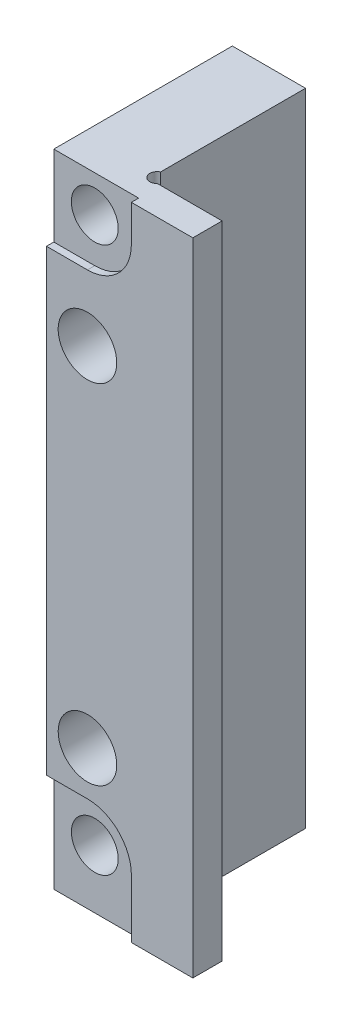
ISO-10303-21;
HEADER;
FILE_DESCRIPTION(('STEP AP214'),'2;1');
FILE_NAME('part.step','',(''),(''),'','','');
FILE_SCHEMA(('AUTOMOTIVE_DESIGN { 1 0 10303 214 1 1 1 1 }'));
ENDSEC;
DATA;
#1=APPLICATION_CONTEXT('core data for automotive mechanical design processes');
#2=APPLICATION_PROTOCOL_DEFINITION('international standard','automotive_design',2000,#1);
#3=PRODUCT_CONTEXT('',#1,'mechanical');
#4=PRODUCT('Part','Part','',(#3));
#5=PRODUCT_RELATED_PRODUCT_CATEGORY('part','',(#4));
#6=PRODUCT_DEFINITION_FORMATION('','',#4);
#7=PRODUCT_DEFINITION_CONTEXT('part definition',#1,'design');
#8=PRODUCT_DEFINITION('design','',#6,#7);
#9=PRODUCT_DEFINITION_SHAPE('','',#8);
#10=(LENGTH_UNIT() NAMED_UNIT(*) SI_UNIT(.MILLI.,.METRE.));
#11=(NAMED_UNIT(*) PLANE_ANGLE_UNIT() SI_UNIT($,.RADIAN.));
#12=(NAMED_UNIT(*) SI_UNIT($,.STERADIAN.) SOLID_ANGLE_UNIT());
#13=UNCERTAINTY_MEASURE_WITH_UNIT(LENGTH_MEASURE(1.E-05),#10,'distance_accuracy_value','');
#14=(GEOMETRIC_REPRESENTATION_CONTEXT(3) GLOBAL_UNCERTAINTY_ASSIGNED_CONTEXT((#13)) GLOBAL_UNIT_ASSIGNED_CONTEXT((#10,
#11,#12)) REPRESENTATION_CONTEXT('',''));
#15=CARTESIAN_POINT('',(0.,0.,0.));
#16=DIRECTION('',(0.,0.,1.));
#17=DIRECTION('',(1.,0.,0.));
#18=AXIS2_PLACEMENT_3D('',#15,#16,#17);
#19=CARTESIAN_POINT('',(-34.9,21.9,-10.));
#20=DIRECTION('',(-1.,0.,0.));
#21=DIRECTION('',(0.,0.,1.));
#22=AXIS2_PLACEMENT_3D('',#19,#20,#21);
#23=PLANE('',#22);
#24=DIRECTION('',(0.,0.,1.));
#25=VECTOR('',#24,1.);
#26=CARTESIAN_POINT('',(-34.9,16.4,-0.5));
#27=LINE('',#26,#25);
#28=CARTESIAN_POINT('',(-34.9,16.4,-0.5));
#29=VERTEX_POINT('',#28);
#30=CARTESIAN_POINT('',(-34.9,16.4,0.));
#31=VERTEX_POINT('',#30);
#32=EDGE_CURVE('E250',#29,#31,#27,.T.);
#33=ORIENTED_EDGE('',*,*,#32,.F.);
#34=DIRECTION('',(0.,-1.,0.));
#35=VECTOR('',#34,1.);
#36=CARTESIAN_POINT('',(-34.9,16.4,-0.5));
#37=LINE('',#36,#35);
#38=CARTESIAN_POINT('',(-34.9,21.9,-0.5));
#39=VERTEX_POINT('',#38);
#40=EDGE_CURVE('E230',#39,#29,#37,.T.);
#41=ORIENTED_EDGE('',*,*,#40,.F.);
#42=DIRECTION('',(0.,0.,1.));
#43=VECTOR('',#42,1.);
#44=CARTESIAN_POINT('',(-34.9,21.9,-10.));
#45=LINE('',#44,#43);
#46=CARTESIAN_POINT('',(-34.9,21.9,-12.7));
#47=VERTEX_POINT('',#46);
#48=EDGE_CURVE('E12',#47,#39,#45,.T.);
#49=ORIENTED_EDGE('',*,*,#48,.F.);
#50=DIRECTION('',(0.,1.,0.));
#51=VECTOR('',#50,1.);
#52=CARTESIAN_POINT('',(-34.9,-21.9,-12.7));
#53=LINE('',#52,#51);
#54=CARTESIAN_POINT('',(-34.9,-21.9,-12.7));
#55=VERTEX_POINT('',#54);
#56=EDGE_CURVE('E203',#55,#47,#53,.T.);
#57=ORIENTED_EDGE('',*,*,#56,.F.);
#58=DIRECTION('',(0.,0.,1.));
#59=VECTOR('',#58,1.);
#60=CARTESIAN_POINT('',(-34.9,-21.9,-10.));
#61=LINE('',#60,#59);
#62=CARTESIAN_POINT('',(-34.9,-21.9,-0.5));
#63=VERTEX_POINT('',#62);
#64=EDGE_CURVE('E343',#55,#63,#61,.T.);
#65=ORIENTED_EDGE('',*,*,#64,.T.);
#66=DIRECTION('',(0.,-1.,0.));
#67=VECTOR('',#66,1.);
#68=CARTESIAN_POINT('',(-34.9,-21.9,-0.5));
#69=LINE('',#68,#67);
#70=CARTESIAN_POINT('',(-34.9,-14.9,-0.5));
#71=VERTEX_POINT('',#70);
#72=EDGE_CURVE('E287',#71,#63,#69,.T.);
#73=ORIENTED_EDGE('',*,*,#72,.F.);
#74=DIRECTION('',(0.,0.,1.));
#75=VECTOR('',#74,1.);
#76=CARTESIAN_POINT('',(-34.9,-14.9,-0.5));
#77=LINE('',#76,#75);
#78=CARTESIAN_POINT('',(-34.9,-14.9,0.));
#79=VERTEX_POINT('',#78);
#80=EDGE_CURVE('E262',#71,#79,#77,.T.);
#81=ORIENTED_EDGE('',*,*,#80,.T.);
#82=DIRECTION('',(0.,-1.,0.));
#83=VECTOR('',#82,1.);
#84=CARTESIAN_POINT('',(-34.9,21.9,0.));
#85=LINE('',#84,#83);
#86=EDGE_CURVE('E329',#31,#79,#85,.T.);
#87=ORIENTED_EDGE('',*,*,#86,.F.);
#88=EDGE_LOOP('',(#33,#41,#49,#57,#65,#73,#81,#87));
#89=FACE_BOUND('',#88,.T.);
#90=ADVANCED_FACE('F64',(#89),#23,.T.);
#91=CARTESIAN_POINT('',(-34.9,21.9,-10.));
#92=DIRECTION('',(0.,1.,0.));
#93=DIRECTION('',(-1.,0.,0.));
#94=AXIS2_PLACEMENT_3D('',#91,#92,#93);
#95=PLANE('',#94);
#96=DIRECTION('',(0.,0.,1.));
#97=VECTOR('',#96,1.);
#98=CARTESIAN_POINT('',(-29.1,21.9,-0.5));
#99=LINE('',#98,#97);
#100=CARTESIAN_POINT('',(-29.1,21.9,-0.5));
#101=VERTEX_POINT('',#100);
#102=CARTESIAN_POINT('',(-29.1,21.9,0.));
#103=VERTEX_POINT('',#102);
#104=EDGE_CURVE('E253',#101,#103,#99,.T.);
#105=ORIENTED_EDGE('',*,*,#104,.T.);
#106=DIRECTION('',(-1.,0.,0.));
#107=VECTOR('',#106,1.);
#108=CARTESIAN_POINT('',(-34.9,21.9,0.));
#109=LINE('',#108,#107);
#110=CARTESIAN_POINT('',(-24.9,21.9,0.));
#111=VERTEX_POINT('',#110);
#112=EDGE_CURVE('E340',#111,#103,#109,.T.);
#113=ORIENTED_EDGE('',*,*,#112,.F.);
#114=DIRECTION('',(0.,0.,1.));
#115=VECTOR('',#114,1.);
#116=CARTESIAN_POINT('',(-24.9,21.9,-10.));
#117=LINE('',#116,#115);
#118=CARTESIAN_POINT('',(-24.8999999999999,21.9,-2.));
#119=VERTEX_POINT('',#118);
#120=EDGE_CURVE('E73',#119,#111,#117,.T.);
#121=ORIENTED_EDGE('',*,*,#120,.F.);
#122=DIRECTION('',(-1.,0.,0.));
#123=VECTOR('',#122,1.);
#124=CARTESIAN_POINT('',(0.,21.8999999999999,-2.));
#125=LINE('',#124,#123);
#126=CARTESIAN_POINT('',(-29.3226741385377,21.9,-2.));
#127=VERTEX_POINT('',#126);
#128=EDGE_CURVE('E185',#119,#127,#125,.T.);
#129=ORIENTED_EDGE('',*,*,#128,.T.);
#130=CARTESIAN_POINT('',(-29.6839888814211,21.9,-2.34561778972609));
#131=DIRECTION('',(0.,-1.,0.));
#132=DIRECTION('',(1.,0.,0.));
#133=AXIS2_PLACEMENT_3D('',#130,#131,#132);
#134=CIRCLE('',#133,0.499999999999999);
#135=CARTESIAN_POINT('',(-29.8999999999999,21.9,-2.79654926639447));
#136=VERTEX_POINT('',#135);
#137=EDGE_CURVE('E182',#127,#136,#134,.T.);
#138=ORIENTED_EDGE('',*,*,#137,.T.);
#139=DIRECTION('',(0.,0.,-1.));
#140=VECTOR('',#139,1.);
#141=CARTESIAN_POINT('',(-29.8999999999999,21.9,0.));
#142=LINE('',#141,#140);
#143=CARTESIAN_POINT('',(-29.8999999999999,21.9,-12.7));
#144=VERTEX_POINT('',#143);
#145=EDGE_CURVE('E174',#136,#144,#142,.T.);
#146=ORIENTED_EDGE('',*,*,#145,.T.);
#147=DIRECTION('',(1.,0.,0.));
#148=VECTOR('',#147,1.);
#149=CARTESIAN_POINT('',(-34.9,21.9,-12.7));
#150=LINE('',#149,#148);
#151=EDGE_CURVE('E179',#47,#144,#150,.T.);
#152=ORIENTED_EDGE('',*,*,#151,.F.);
#153=ORIENTED_EDGE('',*,*,#48,.T.);
#154=DIRECTION('',(-1.,0.,0.));
#155=VECTOR('',#154,1.);
#156=CARTESIAN_POINT('',(-34.9,21.9,-0.5));
#157=LINE('',#156,#155);
#158=EDGE_CURVE('E227',#101,#39,#157,.T.);
#159=ORIENTED_EDGE('',*,*,#158,.F.);
#160=EDGE_LOOP('',(#105,#113,#121,#129,#138,#146,#152,#153,#159));
#161=FACE_BOUND('',#160,.T.);
#162=ADVANCED_FACE('F177',(#161),#95,.T.);
#163=CARTESIAN_POINT('',(-24.9,21.9,-10.));
#164=DIRECTION('',(1.,0.,0.));
#165=DIRECTION('',(0.,1.,0.));
#166=AXIS2_PLACEMENT_3D('',#163,#164,#165);
#167=PLANE('',#166);
#168=DIRECTION('',(0.,-1.,0.));
#169=VECTOR('',#168,1.);
#170=CARTESIAN_POINT('',(-24.8999999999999,21.9,-2.));
#171=LINE('',#170,#169);
#172=CARTESIAN_POINT('',(-24.9,-21.9,-2.));
#173=VERTEX_POINT('',#172);
#174=EDGE_CURVE('E308',#119,#173,#171,.T.);
#175=ORIENTED_EDGE('',*,*,#174,.F.);
#176=ORIENTED_EDGE('',*,*,#120,.T.);
#177=DIRECTION('',(0.,1.,0.));
#178=VECTOR('',#177,1.);
#179=CARTESIAN_POINT('',(-24.9,21.9,0.));
#180=LINE('',#179,#178);
#181=CARTESIAN_POINT('',(-24.9,-21.9,0.));
#182=VERTEX_POINT('',#181);
#183=EDGE_CURVE('E336',#182,#111,#180,.T.);
#184=ORIENTED_EDGE('',*,*,#183,.F.);
#185=DIRECTION('',(0.,0.,1.));
#186=VECTOR('',#185,1.);
#187=CARTESIAN_POINT('',(-24.9,-21.9,-10.));
#188=LINE('',#187,#186);
#189=EDGE_CURVE('E347',#173,#182,#188,.T.);
#190=ORIENTED_EDGE('',*,*,#189,.F.);
#191=EDGE_LOOP('',(#175,#176,#184,#190));
#192=FACE_BOUND('',#191,.T.);
#193=ADVANCED_FACE('F402',(#192),#167,.T.);
#194=CARTESIAN_POINT('',(-24.9,-21.9,-10.));
#195=DIRECTION('',(0.,-1.,0.));
#196=DIRECTION('',(1.,0.,0.));
#197=AXIS2_PLACEMENT_3D('',#194,#195,#196);
#198=PLANE('',#197);
#199=DIRECTION('',(0.,0.,1.));
#200=VECTOR('',#199,1.);
#201=CARTESIAN_POINT('',(-29.1,-21.9,-0.5));
#202=LINE('',#201,#200);
#203=CARTESIAN_POINT('',(-29.1,-21.9,-0.5));
#204=VERTEX_POINT('',#203);
#205=CARTESIAN_POINT('',(-29.1,-21.9,0.));
#206=VERTEX_POINT('',#205);
#207=EDGE_CURVE('E266',#204,#206,#202,.T.);
#208=ORIENTED_EDGE('',*,*,#207,.F.);
#209=DIRECTION('',(1.,0.,0.));
#210=VECTOR('',#209,1.);
#211=CARTESIAN_POINT('',(-29.1,-21.9,-0.5));
#212=LINE('',#211,#210);
#213=EDGE_CURVE('E284',#63,#204,#212,.T.);
#214=ORIENTED_EDGE('',*,*,#213,.F.);
#215=ORIENTED_EDGE('',*,*,#64,.F.);
#216=DIRECTION('',(-1.,0.,0.));
#217=VECTOR('',#216,1.);
#218=CARTESIAN_POINT('',(-29.9,-21.9,-12.7));
#219=LINE('',#218,#217);
#220=CARTESIAN_POINT('',(-29.9,-21.9,-12.7));
#221=VERTEX_POINT('',#220);
#222=EDGE_CURVE('E197',#221,#55,#219,.T.);
#223=ORIENTED_EDGE('',*,*,#222,.F.);
#224=DIRECTION('',(0.,0.,-1.));
#225=VECTOR('',#224,1.);
#226=CARTESIAN_POINT('',(-29.9,-21.9,0.));
#227=LINE('',#226,#225);
#228=CARTESIAN_POINT('',(-29.9,-21.9,-2.79654926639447));
#229=VERTEX_POINT('',#228);
#230=EDGE_CURVE('E192',#229,#221,#227,.T.);
#231=ORIENTED_EDGE('',*,*,#230,.F.);
#232=CARTESIAN_POINT('',(-29.6839888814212,-21.9,-2.34561778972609));
#233=DIRECTION('',(0.,-1.,0.));
#234=DIRECTION('',(1.,0.,0.));
#235=AXIS2_PLACEMENT_3D('',#232,#233,#234);
#236=CIRCLE('',#235,0.499999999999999);
#237=CARTESIAN_POINT('',(-29.3226741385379,-21.9,-2.));
#238=VERTEX_POINT('',#237);
#239=EDGE_CURVE('E319',#238,#229,#236,.T.);
#240=ORIENTED_EDGE('',*,*,#239,.F.);
#241=DIRECTION('',(-1.,0.,0.));
#242=VECTOR('',#241,1.);
#243=CARTESIAN_POINT('',(0.,-21.9000000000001,-2.));
#244=LINE('',#243,#242);
#245=EDGE_CURVE('E186',#173,#238,#244,.T.);
#246=ORIENTED_EDGE('',*,*,#245,.F.);
#247=ORIENTED_EDGE('',*,*,#189,.T.);
#248=DIRECTION('',(1.,0.,0.));
#249=VECTOR('',#248,1.);
#250=CARTESIAN_POINT('',(-24.9,-21.9,0.));
#251=LINE('',#250,#249);
#252=EDGE_CURVE('E333',#206,#182,#251,.T.);
#253=ORIENTED_EDGE('',*,*,#252,.F.);
#254=EDGE_LOOP('',(#208,#214,#215,#223,#231,#240,#246,#247,#253));
#255=FACE_BOUND('',#254,.T.);
#256=ADVANCED_FACE('F582',(#255),#198,.T.);
#257=CARTESIAN_POINT('',(0.,0.,0.));
#258=DIRECTION('',(0.,0.,-1.));
#259=DIRECTION('',(-1.,0.,0.));
#260=AXIS2_PLACEMENT_3D('',#257,#258,#259);
#261=PLANE('',#260);
#262=CARTESIAN_POINT('',(-32.1,11.9,0.));
#263=DIRECTION('',(0.,0.,1.));
#264=DIRECTION('',(1.,0.,0.));
#265=AXIS2_PLACEMENT_3D('',#262,#263,#264);
#266=CIRCLE('',#265,2.);
#267=CARTESIAN_POINT('',(-30.1,11.9,0.));
#268=VERTEX_POINT('',#267);
#269=EDGE_CURVE('E297',#268,#268,#266,.T.);
#270=ORIENTED_EDGE('',*,*,#269,.F.);
#271=EDGE_LOOP('',(#270));
#272=FACE_BOUND('',#271,.T.);
#273=CARTESIAN_POINT('',(-32.1,-11.9,0.));
#274=DIRECTION('',(0.,0.,1.));
#275=DIRECTION('',(-1.,0.,0.));
#276=AXIS2_PLACEMENT_3D('',#273,#274,#275);
#277=CIRCLE('',#276,2.);
#278=CARTESIAN_POINT('',(-34.1,-11.9,0.));
#279=VERTEX_POINT('',#278);
#280=EDGE_CURVE('E302',#279,#279,#277,.T.);
#281=ORIENTED_EDGE('',*,*,#280,.F.);
#282=EDGE_LOOP('',(#281));
#283=FACE_BOUND('',#282,.T.);
#284=CARTESIAN_POINT('',(-32.1,19.4,0.));
#285=DIRECTION('',(0.,0.,1.));
#286=DIRECTION('',(-1.,0.,0.));
#287=AXIS2_PLACEMENT_3D('',#284,#285,#286);
#288=CIRCLE('',#287,3.);
#289=CARTESIAN_POINT('',(-32.1,16.4,0.));
#290=VERTEX_POINT('',#289);
#291=CARTESIAN_POINT('',(-29.1,19.4,0.));
#292=VERTEX_POINT('',#291);
#293=EDGE_CURVE('E81',#290,#292,#288,.T.);
#294=ORIENTED_EDGE('',*,*,#293,.F.);
#295=DIRECTION('',(1.,0.,0.));
#296=VECTOR('',#295,1.);
#297=CARTESIAN_POINT('',(-32.1,16.4,0.));
#298=LINE('',#297,#296);
#299=EDGE_CURVE('E223',#31,#290,#298,.T.);
#300=ORIENTED_EDGE('',*,*,#299,.F.);
#301=ORIENTED_EDGE('',*,*,#86,.T.);
#302=DIRECTION('',(-1.,0.,0.));
#303=VECTOR('',#302,1.);
#304=CARTESIAN_POINT('',(-32.1,-14.9,0.));
#305=LINE('',#304,#303);
#306=CARTESIAN_POINT('',(-32.1,-14.9,0.));
#307=VERTEX_POINT('',#306);
#308=EDGE_CURVE('E275',#307,#79,#305,.T.);
#309=ORIENTED_EDGE('',*,*,#308,.F.);
#310=CARTESIAN_POINT('',(-32.1,-17.9,0.));
#311=DIRECTION('',(0.,0.,1.));
#312=DIRECTION('',(-1.,0.,0.));
#313=AXIS2_PLACEMENT_3D('',#310,#311,#312);
#314=CIRCLE('',#313,3.);
#315=CARTESIAN_POINT('',(-29.1,-17.9,0.));
#316=VERTEX_POINT('',#315);
#317=EDGE_CURVE('E89',#316,#307,#314,.T.);
#318=ORIENTED_EDGE('',*,*,#317,.F.);
#319=DIRECTION('',(0.,1.,0.));
#320=VECTOR('',#319,1.);
#321=CARTESIAN_POINT('',(-29.1,-17.9,0.));
#322=LINE('',#321,#320);
#323=EDGE_CURVE('E271',#206,#316,#322,.T.);
#324=ORIENTED_EDGE('',*,*,#323,.F.);
#325=ORIENTED_EDGE('',*,*,#252,.T.);
#326=ORIENTED_EDGE('',*,*,#183,.T.);
#327=ORIENTED_EDGE('',*,*,#112,.T.);
#328=DIRECTION('',(0.,1.,0.));
#329=VECTOR('',#328,1.);
#330=CARTESIAN_POINT('',(-29.1,19.4,0.));
#331=LINE('',#330,#329);
#332=EDGE_CURVE('E240',#292,#103,#331,.T.);
#333=ORIENTED_EDGE('',*,*,#332,.F.);
#334=EDGE_LOOP('',(#294,#300,#301,#309,#318,#324,#325,#326,#327,#333));
#335=FACE_BOUND('',#334,.T.);
#336=ADVANCED_FACE('F388',(#272,#283,#335),#261,.F.);
#337=CARTESIAN_POINT('',(0.,21.8999999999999,-2.));
#338=DIRECTION('',(0.,0.,1.));
#339=DIRECTION('',(1.,0.,0.));
#340=AXIS2_PLACEMENT_3D('',#337,#338,#339);
#341=PLANE('',#340);
#342=DIRECTION('',(0.,-1.,0.));
#343=VECTOR('',#342,1.);
#344=CARTESIAN_POINT('',(-29.3226741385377,21.9,-2.));
#345=LINE('',#344,#343);
#346=EDGE_CURVE('E316',#238,#127,#345,.F.);
#347=ORIENTED_EDGE('',*,*,#346,.T.);
#348=ORIENTED_EDGE('',*,*,#128,.F.);
#349=ORIENTED_EDGE('',*,*,#174,.T.);
#350=ORIENTED_EDGE('',*,*,#245,.T.);
#351=EDGE_LOOP('',(#347,#348,#349,#350));
#352=FACE_BOUND('',#351,.T.);
#353=ADVANCED_FACE('F386',(#352),#341,.F.);
#354=CARTESIAN_POINT('',(-29.8999999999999,21.9,0.));
#355=DIRECTION('',(-1.,0.,0.));
#356=DIRECTION('',(0.,-1.,0.));
#357=AXIS2_PLACEMENT_3D('',#354,#355,#356);
#358=PLANE('',#357);
#359=DIRECTION('',(0.,-1.,0.));
#360=VECTOR('',#359,1.);
#361=CARTESIAN_POINT('',(-29.8999999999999,21.9,-2.79654926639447));
#362=LINE('',#361,#360);
#363=EDGE_CURVE('E326',#136,#229,#362,.T.);
#364=ORIENTED_EDGE('',*,*,#363,.T.);
#365=ORIENTED_EDGE('',*,*,#230,.T.);
#366=DIRECTION('',(0.,-1.,0.));
#367=VECTOR('',#366,1.);
#368=CARTESIAN_POINT('',(-29.8999999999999,21.9,-12.7));
#369=LINE('',#368,#367);
#370=EDGE_CURVE('E189',#144,#221,#369,.T.);
#371=ORIENTED_EDGE('',*,*,#370,.F.);
#372=ORIENTED_EDGE('',*,*,#145,.F.);
#373=EDGE_LOOP('',(#364,#365,#371,#372));
#374=FACE_BOUND('',#373,.T.);
#375=ADVANCED_FACE('F190',(#374),#358,.F.);
#376=CARTESIAN_POINT('',(-29.6839888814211,21.9,-2.34561778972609));
#377=DIRECTION('',(0.,-1.,0.));
#378=DIRECTION('',(1.,0.,0.));
#379=AXIS2_PLACEMENT_3D('',#376,#377,#378);
#380=CYLINDRICAL_SURFACE('',#379,0.499999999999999);
#381=CARTESIAN_POINT('',(-30.1,11.9,-2.62298892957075));
#382=CARTESIAN_POINT('',(-30.1000000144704,11.8709885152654,-2.62298896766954));
#383=CARTESIAN_POINT('',(-30.1006322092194,11.8419764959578,-2.62204766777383));
#384=CARTESIAN_POINT('',(-30.1031491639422,11.7841365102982,-2.61821644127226));
#385=CARTESIAN_POINT('',(-30.1050337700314,11.7553085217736,-2.61532675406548));
#386=CARTESIAN_POINT('',(-30.1100169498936,11.6980227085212,-2.60738545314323));
#387=CARTESIAN_POINT('',(-30.1131167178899,11.669565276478,-2.60233171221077));
#388=CARTESIAN_POINT('',(-30.120440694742,11.6133919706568,-2.58967514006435));
#389=CARTESIAN_POINT('',(-30.1246632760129,11.5856750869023,-2.58207599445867));
#390=CARTESIAN_POINT('',(-30.1337031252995,11.5334955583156,-2.56436132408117));
#391=CARTESIAN_POINT('',(-30.1384526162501,11.508944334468,-2.55447555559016));
#392=CARTESIAN_POINT('',(-30.1484595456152,11.4617525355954,-2.53117039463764));
#393=CARTESIAN_POINT('',(-30.1537137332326,11.4391012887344,-2.5177727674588));
#394=CARTESIAN_POINT('',(-30.1612342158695,11.4087935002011,-2.49491974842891));
#395=CARTESIAN_POINT('',(-30.1635555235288,11.399738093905,-2.48734479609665));
#396=CARTESIAN_POINT('',(-30.1680643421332,11.38260030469,-2.47108715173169));
#397=CARTESIAN_POINT('',(-30.1702516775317,11.3745191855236,-2.46240305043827));
#398=CARTESIAN_POINT('',(-30.174365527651,11.3596367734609,-2.44371718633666));
#399=CARTESIAN_POINT('',(-30.1762880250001,11.3528546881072,-2.4336988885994));
#400=CARTESIAN_POINT('',(-30.179611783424,11.34130006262,-2.4124884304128));
#401=CARTESIAN_POINT('',(-30.1810149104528,11.3365203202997,-2.40130066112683));
#402=CARTESIAN_POINT('',(-30.1827404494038,11.3306829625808,-2.38180836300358));
#403=CARTESIAN_POINT('',(-30.1832651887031,11.3289230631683,-2.37373105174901));
#404=CARTESIAN_POINT('',(-30.1839171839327,11.3267391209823,-2.35738118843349));
#405=CARTESIAN_POINT('',(-30.184044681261,11.3263142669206,-2.34910875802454));
#406=CARTESIAN_POINT('',(-30.1838877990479,11.3268385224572,-2.33261035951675));
#407=CARTESIAN_POINT('',(-30.1836033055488,11.3277880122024,-2.32438440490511));
#408=CARTESIAN_POINT('',(-30.1826536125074,11.3309784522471,-2.30821050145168));
#409=CARTESIAN_POINT('',(-30.181988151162,11.3332202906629,-2.3002627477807));
#410=CARTESIAN_POINT('',(-30.1801174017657,11.3395855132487,-2.28274029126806));
#411=CARTESIAN_POINT('',(-30.1788151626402,11.3440524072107,-2.27330146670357));
#412=CARTESIAN_POINT('',(-30.1758495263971,11.3544048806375,-2.25530290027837));
#413=CARTESIAN_POINT('',(-30.174185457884,11.3602930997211,-2.24674483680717));
#414=CARTESIAN_POINT('',(-30.1697325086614,11.3763904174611,-2.22641084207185));
#415=CARTESIAN_POINT('',(-30.1668013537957,11.3872758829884,-2.21520580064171));
#416=CARTESIAN_POINT('',(-30.160764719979,11.4105986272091,-2.194622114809));
#417=CARTESIAN_POINT('',(-30.1576588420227,11.4230395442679,-2.18524788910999));
#418=CARTESIAN_POINT('',(-30.1490706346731,11.4590564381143,-2.16131521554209));
#419=CARTESIAN_POINT('',(-30.1436267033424,11.483740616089,-2.14842558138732));
#420=CARTESIAN_POINT('',(-30.1334532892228,11.534787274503,-2.12623693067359));
#421=CARTESIAN_POINT('',(-30.1287257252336,11.5611540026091,-2.11694745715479));
#422=CARTESIAN_POINT('',(-30.1206243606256,11.6124506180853,-2.10186501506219));
#423=CARTESIAN_POINT('',(-30.1171674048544,11.6372987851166,-2.09583401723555));
#424=CARTESIAN_POINT('',(-30.111159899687,11.6875002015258,-2.08569707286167));
#425=CARTESIAN_POINT('',(-30.108610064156,11.7128538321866,-2.08159264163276));
#426=CARTESIAN_POINT('',(-30.1024033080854,11.7894251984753,-2.07176642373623));
#427=CARTESIAN_POINT('',(-30.1001987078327,11.8410938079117,-2.06854751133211));
#428=CARTESIAN_POINT('',(-30.0998154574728,11.9477783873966,-2.06796685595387));
#429=CARTESIAN_POINT('',(-30.1019017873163,12.0027982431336,-2.07099066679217));
#430=CARTESIAN_POINT('',(-30.1083230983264,12.0843081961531,-2.08113173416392));
#431=CARTESIAN_POINT('',(-30.1110102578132,12.1112965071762,-2.08544317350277));
#432=CARTESIAN_POINT('',(-30.1174121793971,12.1646989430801,-2.0962485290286));
#433=CARTESIAN_POINT('',(-30.1211259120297,12.1911136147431,-2.10274026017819));
#434=CARTESIAN_POINT('',(-30.1294669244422,12.243065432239,-2.11839891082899));
#435=CARTESIAN_POINT('',(-30.1340961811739,12.2686005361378,-2.12757164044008));
#436=CARTESIAN_POINT('',(-30.1440112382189,12.3180115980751,-2.14934040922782));
#437=CARTESIAN_POINT('',(-30.1492943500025,12.3418937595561,-2.16192266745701));
#438=CARTESIAN_POINT('',(-30.1572345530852,12.3751750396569,-2.18407331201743));
#439=CARTESIAN_POINT('',(-30.1598542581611,12.3857397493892,-2.19189717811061));
#440=CARTESIAN_POINT('',(-30.1649964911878,12.405833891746,-2.20883179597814));
#441=CARTESIAN_POINT('',(-30.1675190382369,12.4153635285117,-2.21794229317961));
#442=CARTESIAN_POINT('',(-30.1718895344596,12.4314583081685,-2.23596425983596));
#443=CARTESIAN_POINT('',(-30.1737799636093,12.4382529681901,-2.24465785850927));
#444=CARTESIAN_POINT('',(-30.1772154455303,12.4503992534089,-2.26306666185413));
#445=CARTESIAN_POINT('',(-30.1787611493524,12.4557536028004,-2.27277988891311));
#446=CARTESIAN_POINT('',(-30.1810307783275,12.4635332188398,-2.29074374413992));
#447=CARTESIAN_POINT('',(-30.1818621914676,12.4663499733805,-2.29880997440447));
#448=CARTESIAN_POINT('',(-30.1831385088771,12.4706550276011,-2.31532007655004));
#449=CARTESIAN_POINT('',(-30.1835837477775,12.4721444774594,-2.32376361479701));
#450=CARTESIAN_POINT('',(-30.1840389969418,12.4736672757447,-2.34082781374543));
#451=CARTESIAN_POINT('',(-30.18404734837,12.4736950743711,-2.34944902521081));
#452=CARTESIAN_POINT('',(-30.1836235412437,12.4722776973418,-2.36655856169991));
#453=CARTESIAN_POINT('',(-30.1831912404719,12.4708320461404,-2.37504684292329));
#454=CARTESIAN_POINT('',(-30.1819663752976,12.4667020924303,-2.39123863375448));
#455=CARTESIAN_POINT('',(-30.1811923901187,12.4640815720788,-2.39896022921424));
#456=CARTESIAN_POINT('',(-30.1793580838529,12.4578040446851,-2.41392818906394));
#457=CARTESIAN_POINT('',(-30.1782976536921,12.4541466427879,-2.42117437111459));
#458=CARTESIAN_POINT('',(-30.1752816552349,12.4436026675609,-2.43919636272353));
#459=CARTESIAN_POINT('',(-30.1731644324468,12.4360759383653,-2.44957018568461));
#460=CARTESIAN_POINT('',(-30.1686362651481,12.4195272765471,-2.46897332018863));
#461=CARTESIAN_POINT('',(-30.1662245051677,12.4105011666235,-2.47799873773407));
#462=CARTESIAN_POINT('',(-30.1596471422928,12.385073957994,-2.50042073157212));
#463=CARTESIAN_POINT('',(-30.1553804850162,12.3677559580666,-2.51273963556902));
#464=CARTESIAN_POINT('',(-30.1470073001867,12.3314765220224,-2.53469518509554));
#465=CARTESIAN_POINT('',(-30.1429012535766,12.3125106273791,-2.54432423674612));
#466=CARTESIAN_POINT('',(-30.1317114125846,12.2566583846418,-2.56891468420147));
#467=CARTESIAN_POINT('',(-30.1251398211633,12.2185183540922,-2.58124076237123));
#468=CARTESIAN_POINT('',(-30.1141489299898,12.1407368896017,-2.60072605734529));
#469=CARTESIAN_POINT('',(-30.1097313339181,12.1010942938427,-2.60788118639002));
#470=CARTESIAN_POINT('',(-30.1043458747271,12.0344618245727,-2.61638467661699));
#471=CARTESIAN_POINT('',(-30.1027188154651,12.0076626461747,-2.61887387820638));
#472=CARTESIAN_POINT('',(-30.1005456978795,11.9539091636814,-2.62217625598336));
#473=CARTESIAN_POINT('',(-30.0999999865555,11.9269548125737,-2.62298889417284));
#474=CARTESIAN_POINT('',(-30.1,11.9,-2.62298892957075));
#475=B_SPLINE_CURVE_WITH_KNOTS('',3,(#381,#382,#383,#384,#385,#386,#387,#388,#389,#390,#391,
#392,#393,#394,#395,#396,#397,#398,#399,#400,#401,#402,#403,#404,#405,#406,#407,#408,#409,#410,
#411,#412,#413,#414,#415,#416,#417,#418,#419,#420,#421,#422,#423,#424,#425,#426,#427,#428,#429,
#430,#431,#432,#433,#434,#435,#436,#437,#438,#439,#440,#441,#442,#443,#444,#445,#446,#447,#448,
#449,#450,#451,#452,#453,#454,#455,#456,#457,#458,#459,#460,#461,#462,#463,#464,#465,#466,#467,
#468,#469,#470,#471,#472,#473,#474),.UNSPECIFIED.,.T.,.F.,(4,2,2,2,2,2,2,2,2,2,2,2,2,2,2,2,2,2,
2,2,2,2,2,2,2,2,2,2,2,2,2,2,2,2,2,2,2,2,2,2,2,2,2,2,2,2,4),(0.,0.0870127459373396,
0.174014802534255,0.261102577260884,0.348064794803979,0.428545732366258,0.508539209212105,
0.544566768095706,0.580640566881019,0.617212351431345,0.653651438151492,0.678394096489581,
0.703121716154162,0.727856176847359,0.75260765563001,0.784002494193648,0.815456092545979,
0.862871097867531,0.910399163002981,0.99504553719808,1.07991477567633,1.15721118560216,
1.23456829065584,1.38946763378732,1.55421900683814,1.63652198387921,1.71874272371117,
1.80114298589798,1.88321503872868,1.92335563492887,1.96348830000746,1.99696092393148,
2.03036978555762,2.05601774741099,2.0816434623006,2.10736646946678,2.13309778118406,
2.15757539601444,2.18206234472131,2.22080954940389,2.2596665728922,2.32432900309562,
2.38917218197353,2.51035066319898,2.63162483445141,2.7124431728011,2.79328744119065),.UNSPECIFIED.);
#476=CARTESIAN_POINT('',(-30.1,11.9,-2.62298892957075));
#477=VERTEX_POINT('',#476);
#478=EDGE_CURVE('E323',#477,#477,#475,.T.);
#479=ORIENTED_EDGE('',*,*,#478,.T.);
#480=EDGE_LOOP('',(#479));
#481=FACE_BOUND('',#480,.T.);
#482=CARTESIAN_POINT('',(-30.1,-11.9,-2.62298892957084));
#483=CARTESIAN_POINT('',(-30.1000000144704,-11.9290114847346,-2.62298896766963));
#484=CARTESIAN_POINT('',(-30.1006322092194,-11.9580235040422,-2.62204766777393));
#485=CARTESIAN_POINT('',(-30.1031491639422,-12.0158634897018,-2.61821644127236));
#486=CARTESIAN_POINT('',(-30.1050337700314,-12.0446914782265,-2.61532675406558));
#487=CARTESIAN_POINT('',(-30.1100169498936,-12.1019772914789,-2.60738545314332));
#488=CARTESIAN_POINT('',(-30.1131167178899,-12.1304347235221,-2.60233171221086));
#489=CARTESIAN_POINT('',(-30.120440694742,-12.1866080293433,-2.58967514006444));
#490=CARTESIAN_POINT('',(-30.1246632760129,-12.2143249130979,-2.58207599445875));
#491=CARTESIAN_POINT('',(-30.1337031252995,-12.2665044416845,-2.56436132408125));
#492=CARTESIAN_POINT('',(-30.1384526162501,-12.2910556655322,-2.55447555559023));
#493=CARTESIAN_POINT('',(-30.1484595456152,-12.3382474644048,-2.53117039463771));
#494=CARTESIAN_POINT('',(-30.1537137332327,-12.3608987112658,-2.51777276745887));
#495=CARTESIAN_POINT('',(-30.1612342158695,-12.3912064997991,-2.49491974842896));
#496=CARTESIAN_POINT('',(-30.1635555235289,-12.4002619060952,-2.4873447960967));
#497=CARTESIAN_POINT('',(-30.1680643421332,-12.4173996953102,-2.47108715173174));
#498=CARTESIAN_POINT('',(-30.1702516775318,-12.4254808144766,-2.46240305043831));
#499=CARTESIAN_POINT('',(-30.174365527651,-12.4403632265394,-2.4437171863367));
#500=CARTESIAN_POINT('',(-30.1762880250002,-12.4471453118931,-2.43369888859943));
#501=CARTESIAN_POINT('',(-30.179611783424,-12.4586999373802,-2.41248843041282));
#502=CARTESIAN_POINT('',(-30.1810149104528,-12.4634796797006,-2.40130066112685));
#503=CARTESIAN_POINT('',(-30.1827404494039,-12.4693170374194,-2.38180836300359));
#504=CARTESIAN_POINT('',(-30.1832651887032,-12.4710769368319,-2.37373105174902));
#505=CARTESIAN_POINT('',(-30.1839171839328,-12.473260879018,-2.35738118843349));
#506=CARTESIAN_POINT('',(-30.1840446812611,-12.4736857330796,-2.34910875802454));
#507=CARTESIAN_POINT('',(-30.1838877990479,-12.4731614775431,-2.33261035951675));
#508=CARTESIAN_POINT('',(-30.1836033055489,-12.4722119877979,-2.3243844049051));
#509=CARTESIAN_POINT('',(-30.1826536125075,-12.4690215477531,-2.30821050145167));
#510=CARTESIAN_POINT('',(-30.181988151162,-12.4667797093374,-2.30026274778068));
#511=CARTESIAN_POINT('',(-30.1801174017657,-12.4604144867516,-2.28274029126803));
#512=CARTESIAN_POINT('',(-30.1788151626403,-12.4559475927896,-2.27330146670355));
#513=CARTESIAN_POINT('',(-30.1758495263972,-12.4455951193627,-2.25530290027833));
#514=CARTESIAN_POINT('',(-30.1741854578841,-12.4397069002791,-2.24674483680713));
#515=CARTESIAN_POINT('',(-30.1697325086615,-12.4236095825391,-2.2264108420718));
#516=CARTESIAN_POINT('',(-30.1668013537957,-12.4127241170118,-2.21520580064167));
#517=CARTESIAN_POINT('',(-30.1607647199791,-12.3894013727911,-2.19462211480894));
#518=CARTESIAN_POINT('',(-30.1576588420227,-12.3769604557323,-2.18524788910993));
#519=CARTESIAN_POINT('',(-30.1490706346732,-12.3409435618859,-2.16131521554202));
#520=CARTESIAN_POINT('',(-30.1436267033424,-12.3162593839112,-2.14842558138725));
#521=CARTESIAN_POINT('',(-30.1334532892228,-12.2652127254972,-2.12623693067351));
#522=CARTESIAN_POINT('',(-30.1287257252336,-12.2388459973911,-2.11694745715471));
#523=CARTESIAN_POINT('',(-30.1206243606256,-12.1875493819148,-2.10186501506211));
#524=CARTESIAN_POINT('',(-30.1171674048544,-12.1627012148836,-2.09583401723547));
#525=CARTESIAN_POINT('',(-30.111159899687,-12.1124997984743,-2.08569707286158));
#526=CARTESIAN_POINT('',(-30.108610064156,-12.0871461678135,-2.08159264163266));
#527=CARTESIAN_POINT('',(-30.1024033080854,-12.0105748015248,-2.07176642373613));
#528=CARTESIAN_POINT('',(-30.1001987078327,-11.9589061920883,-2.06854751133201));
#529=CARTESIAN_POINT('',(-30.0998154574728,-11.8522216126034,-2.06796685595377));
#530=CARTESIAN_POINT('',(-30.1019017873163,-11.7972017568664,-2.07099066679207));
#531=CARTESIAN_POINT('',(-30.1083230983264,-11.7156918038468,-2.08113173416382));
#532=CARTESIAN_POINT('',(-30.1110102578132,-11.6887034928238,-2.08544317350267));
#533=CARTESIAN_POINT('',(-30.1174121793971,-11.6353010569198,-2.0962485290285));
#534=CARTESIAN_POINT('',(-30.1211259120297,-11.6088863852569,-2.10274026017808));
#535=CARTESIAN_POINT('',(-30.1294669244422,-11.556934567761,-2.11839891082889));
#536=CARTESIAN_POINT('',(-30.134096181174,-11.5313994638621,-2.12757164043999));
#537=CARTESIAN_POINT('',(-30.1440112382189,-11.4819884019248,-2.14934040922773));
#538=CARTESIAN_POINT('',(-30.1492943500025,-11.4581062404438,-2.16192266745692));
#539=CARTESIAN_POINT('',(-30.1572345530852,-11.424824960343,-2.18407331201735));
#540=CARTESIAN_POINT('',(-30.1598542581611,-11.4142602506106,-2.19189717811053));
#541=CARTESIAN_POINT('',(-30.1649964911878,-11.3941661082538,-2.20883179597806));
#542=CARTESIAN_POINT('',(-30.1675190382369,-11.3846364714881,-2.21794229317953));
#543=CARTESIAN_POINT('',(-30.1718895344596,-11.3685416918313,-2.23596425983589));
#544=CARTESIAN_POINT('',(-30.1737799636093,-11.3617470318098,-2.2446578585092));
#545=CARTESIAN_POINT('',(-30.1772154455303,-11.3496007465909,-2.26306666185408));
#546=CARTESIAN_POINT('',(-30.1787611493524,-11.3442463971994,-2.27277988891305));
#547=CARTESIAN_POINT('',(-30.1810307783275,-11.33646678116,-2.29074374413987));
#548=CARTESIAN_POINT('',(-30.1818621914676,-11.3336500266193,-2.29880997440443));
#549=CARTESIAN_POINT('',(-30.1831385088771,-11.3293449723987,-2.31532007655));
#550=CARTESIAN_POINT('',(-30.1835837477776,-11.3278555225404,-2.32376361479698));
#551=CARTESIAN_POINT('',(-30.1840389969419,-11.3263327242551,-2.3408278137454));
#552=CARTESIAN_POINT('',(-30.18404734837,-11.3263049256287,-2.34944902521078));
#553=CARTESIAN_POINT('',(-30.1836235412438,-11.327722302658,-2.36655856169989));
#554=CARTESIAN_POINT('',(-30.183191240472,-11.3291679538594,-2.37504684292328));
#555=CARTESIAN_POINT('',(-30.1819663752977,-11.3332979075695,-2.39123863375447));
#556=CARTESIAN_POINT('',(-30.1811923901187,-11.335918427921,-2.39896022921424));
#557=CARTESIAN_POINT('',(-30.1793580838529,-11.3421959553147,-2.41392818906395));
#558=CARTESIAN_POINT('',(-30.1782976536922,-11.3458533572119,-2.4211743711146));
#559=CARTESIAN_POINT('',(-30.175281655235,-11.3563973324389,-2.43919636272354));
#560=CARTESIAN_POINT('',(-30.1731644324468,-11.3639240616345,-2.44957018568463));
#561=CARTESIAN_POINT('',(-30.1686362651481,-11.3804727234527,-2.46897332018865));
#562=CARTESIAN_POINT('',(-30.1662245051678,-11.3894988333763,-2.47799873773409));
#563=CARTESIAN_POINT('',(-30.1596471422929,-11.4149260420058,-2.50042073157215));
#564=CARTESIAN_POINT('',(-30.1553804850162,-11.4322440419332,-2.51273963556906));
#565=CARTESIAN_POINT('',(-30.1470073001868,-11.4685234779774,-2.53469518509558));
#566=CARTESIAN_POINT('',(-30.1429012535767,-11.4874893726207,-2.54432423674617));
#567=CARTESIAN_POINT('',(-30.1317114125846,-11.543341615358,-2.56891468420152));
#568=CARTESIAN_POINT('',(-30.1251398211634,-11.5814816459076,-2.58124076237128));
#569=CARTESIAN_POINT('',(-30.1141489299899,-11.6592631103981,-2.60072605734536));
#570=CARTESIAN_POINT('',(-30.1097313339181,-11.6989057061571,-2.60788118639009));
#571=CARTESIAN_POINT('',(-30.1043458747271,-11.7655381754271,-2.61638467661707));
#572=CARTESIAN_POINT('',(-30.1027188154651,-11.7923373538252,-2.61887387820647));
#573=CARTESIAN_POINT('',(-30.1005456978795,-11.8460908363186,-2.62217625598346));
#574=CARTESIAN_POINT('',(-30.0999999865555,-11.8730451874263,-2.62298889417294));
#575=CARTESIAN_POINT('',(-30.1,-11.9,-2.62298892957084));
#576=B_SPLINE_CURVE_WITH_KNOTS('',3,(#482,#483,#484,#485,#486,#487,#488,#489,#490,#491,#492,
#493,#494,#495,#496,#497,#498,#499,#500,#501,#502,#503,#504,#505,#506,#507,#508,#509,#510,#511,
#512,#513,#514,#515,#516,#517,#518,#519,#520,#521,#522,#523,#524,#525,#526,#527,#528,#529,#530,
#531,#532,#533,#534,#535,#536,#537,#538,#539,#540,#541,#542,#543,#544,#545,#546,#547,#548,#549,
#550,#551,#552,#553,#554,#555,#556,#557,#558,#559,#560,#561,#562,#563,#564,#565,#566,#567,#568,
#569,#570,#571,#572,#573,#574,#575),.UNSPECIFIED.,.T.,.F.,(4,2,2,2,2,2,2,2,2,2,2,2,2,2,2,2,2,2,
2,2,2,2,2,2,2,2,2,2,2,2,2,2,2,2,2,2,2,2,2,2,2,2,2,2,2,2,4),(0.,0.0870127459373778,
0.174014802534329,0.261102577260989,0.348064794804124,0.428545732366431,0.508539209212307,
0.544566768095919,0.580640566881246,0.617212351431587,0.653651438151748,0.678394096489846,
0.703121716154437,0.727856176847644,0.752607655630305,0.784002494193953,0.815456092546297,
0.862871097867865,0.910399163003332,0.995045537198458,1.07991477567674,1.1572111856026,
1.2345682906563,1.38946763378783,1.55421900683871,1.6365219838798,1.71874272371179,
1.80114298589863,1.88321503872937,1.92335563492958,1.96348830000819,1.99696092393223,
2.03036978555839,2.05601774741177,2.08164346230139,2.10736646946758,2.13309778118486,
2.15757539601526,2.18206234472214,2.22080954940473,2.25966657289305,2.32432900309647,
2.38917218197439,2.51035066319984,2.63162483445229,2.71244317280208,2.79328744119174),.UNSPECIFIED.);
#577=CARTESIAN_POINT('',(-30.1,-11.9,-2.62298892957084));
#578=VERTEX_POINT('',#577);
#579=EDGE_CURVE('E301',#578,#578,#576,.T.);
#580=ORIENTED_EDGE('',*,*,#579,.T.);
#581=EDGE_LOOP('',(#580));
#582=FACE_BOUND('',#581,.T.);
#583=ORIENTED_EDGE('',*,*,#137,.F.);
#584=ORIENTED_EDGE('',*,*,#346,.F.);
#585=ORIENTED_EDGE('',*,*,#239,.T.);
#586=ORIENTED_EDGE('',*,*,#363,.F.);
#587=EDGE_LOOP('',(#583,#584,#585,#586));
#588=FACE_BOUND('',#587,.T.);
#589=ADVANCED_FACE('F366',(#481,#582,#588),#380,.F.);
#590=CARTESIAN_POINT('',(-32.1,19.4,-10.));
#591=DIRECTION('',(0.,0.,1.));
#592=DIRECTION('',(1.,0.,0.));
#593=AXIS2_PLACEMENT_3D('',#590,#591,#592);
#594=CYLINDRICAL_SURFACE('',#593,1.6);
#595=CARTESIAN_POINT('',(-32.1,19.4,-0.5));
#596=DIRECTION('',(0.,0.,-1.));
#597=DIRECTION('',(-1.,0.,0.));
#598=AXIS2_PLACEMENT_3D('',#595,#596,#597);
#599=CIRCLE('',#598,1.6);
#600=CARTESIAN_POINT('',(-33.7,19.4,-0.5));
#601=VERTEX_POINT('',#600);
#602=EDGE_CURVE('E67',#601,#601,#599,.F.);
#603=ORIENTED_EDGE('',*,*,#602,.T.);
#604=EDGE_LOOP('',(#603));
#605=FACE_BOUND('',#604,.T.);
#606=CARTESIAN_POINT('',(-32.1,19.4,-12.7));
#607=DIRECTION('',(0.,0.,-1.));
#608=DIRECTION('',(-1.,0.,0.));
#609=AXIS2_PLACEMENT_3D('',#606,#607,#608);
#610=CIRCLE('',#609,1.6);
#611=CARTESIAN_POINT('',(-33.7,19.4,-12.7));
#612=VERTEX_POINT('',#611);
#613=EDGE_CURVE('E465',#612,#612,#610,.T.);
#614=ORIENTED_EDGE('',*,*,#613,.T.);
#615=EDGE_LOOP('',(#614));
#616=FACE_BOUND('',#615,.T.);
#617=ADVANCED_FACE('F381',(#605,#616),#594,.F.);
#618=CARTESIAN_POINT('',(-32.1,-17.9,-10.));
#619=DIRECTION('',(0.,0.,1.));
#620=DIRECTION('',(1.,0.,0.));
#621=AXIS2_PLACEMENT_3D('',#618,#619,#620);
#622=CYLINDRICAL_SURFACE('',#621,1.6);
#623=CARTESIAN_POINT('',(-32.1,-17.9,-0.5));
#624=DIRECTION('',(0.,0.,-1.));
#625=DIRECTION('',(-1.,0.,0.));
#626=AXIS2_PLACEMENT_3D('',#623,#624,#625);
#627=CIRCLE('',#626,1.6);
#628=CARTESIAN_POINT('',(-33.7,-17.9,-0.5));
#629=VERTEX_POINT('',#628);
#630=EDGE_CURVE('E249',#629,#629,#627,.F.);
#631=ORIENTED_EDGE('',*,*,#630,.T.);
#632=EDGE_LOOP('',(#631));
#633=FACE_BOUND('',#632,.T.);
#634=CARTESIAN_POINT('',(-32.1,-17.9,-12.7));
#635=DIRECTION('',(0.,0.,-1.));
#636=DIRECTION('',(-1.,0.,0.));
#637=AXIS2_PLACEMENT_3D('',#634,#635,#636);
#638=CIRCLE('',#637,1.6);
#639=CARTESIAN_POINT('',(-33.7,-17.9,-12.7));
#640=VERTEX_POINT('',#639);
#641=EDGE_CURVE('E468',#640,#640,#638,.T.);
#642=ORIENTED_EDGE('',*,*,#641,.T.);
#643=EDGE_LOOP('',(#642));
#644=FACE_BOUND('',#643,.T.);
#645=ADVANCED_FACE('F375',(#633,#644),#622,.F.);
#646=CARTESIAN_POINT('',(-32.1,-11.9,-10.));
#647=DIRECTION('',(0.,0.,1.));
#648=DIRECTION('',(1.,0.,0.));
#649=AXIS2_PLACEMENT_3D('',#646,#647,#648);
#650=CYLINDRICAL_SURFACE('',#649,2.);
#651=ORIENTED_EDGE('',*,*,#280,.T.);
#652=EDGE_LOOP('',(#651));
#653=FACE_BOUND('',#652,.T.);
#654=ORIENTED_EDGE('',*,*,#579,.F.);
#655=EDGE_LOOP('',(#654));
#656=FACE_BOUND('',#655,.T.);
#657=CARTESIAN_POINT('',(-32.1,-11.9,-12.7));
#658=DIRECTION('',(0.,0.,-1.));
#659=DIRECTION('',(-1.,0.,0.));
#660=AXIS2_PLACEMENT_3D('',#657,#658,#659);
#661=CIRCLE('',#660,2.);
#662=CARTESIAN_POINT('',(-34.1,-11.9,-12.7));
#663=VERTEX_POINT('',#662);
#664=EDGE_CURVE('E209',#663,#663,#661,.T.);
#665=ORIENTED_EDGE('',*,*,#664,.T.);
#666=EDGE_LOOP('',(#665));
#667=FACE_BOUND('',#666,.T.);
#668=ADVANCED_FACE('F370',(#653,#656,#667),#650,.F.);
#669=CARTESIAN_POINT('',(-32.1,11.9,-10.));
#670=DIRECTION('',(0.,0.,1.));
#671=DIRECTION('',(1.,0.,0.));
#672=AXIS2_PLACEMENT_3D('',#669,#670,#671);
#673=CYLINDRICAL_SURFACE('',#672,2.);
#674=ORIENTED_EDGE('',*,*,#269,.T.);
#675=EDGE_LOOP('',(#674));
#676=FACE_BOUND('',#675,.T.);
#677=ORIENTED_EDGE('',*,*,#478,.F.);
#678=EDGE_LOOP('',(#677));
#679=FACE_BOUND('',#678,.T.);
#680=CARTESIAN_POINT('',(-32.1,11.9,-12.7));
#681=DIRECTION('',(0.,0.,-1.));
#682=DIRECTION('',(-1.,0.,0.));
#683=AXIS2_PLACEMENT_3D('',#680,#681,#682);
#684=CIRCLE('',#683,2.);
#685=CARTESIAN_POINT('',(-34.1,11.9,-12.7));
#686=VERTEX_POINT('',#685);
#687=EDGE_CURVE('E205',#686,#686,#684,.T.);
#688=ORIENTED_EDGE('',*,*,#687,.T.);
#689=EDGE_LOOP('',(#688));
#690=FACE_BOUND('',#689,.T.);
#691=ADVANCED_FACE('F374',(#676,#679,#690),#673,.F.);
#692=CARTESIAN_POINT('',(-32.1,-17.9,-0.5));
#693=DIRECTION('',(0.,0.,-1.));
#694=DIRECTION('',(-1.,0.,0.));
#695=AXIS2_PLACEMENT_3D('',#692,#693,#694);
#696=PLANE('',#695);
#697=CARTESIAN_POINT('',(-32.1,-17.9,-0.5));
#698=DIRECTION('',(0.,0.,1.));
#699=DIRECTION('',(-1.,0.,0.));
#700=AXIS2_PLACEMENT_3D('',#697,#698,#699);
#701=CIRCLE('',#700,3.);
#702=CARTESIAN_POINT('',(-29.1,-17.9,-0.5));
#703=VERTEX_POINT('',#702);
#704=CARTESIAN_POINT('',(-32.1,-14.9,-0.5));
#705=VERTEX_POINT('',#704);
#706=EDGE_CURVE('E276',#703,#705,#701,.T.);
#707=ORIENTED_EDGE('',*,*,#706,.T.);
#708=DIRECTION('',(-1.,0.,0.));
#709=VECTOR('',#708,1.);
#710=CARTESIAN_POINT('',(-32.1,-14.9,-0.5));
#711=LINE('',#710,#709);
#712=EDGE_CURVE('E290',#705,#71,#711,.T.);
#713=ORIENTED_EDGE('',*,*,#712,.T.);
#714=ORIENTED_EDGE('',*,*,#72,.T.);
#715=ORIENTED_EDGE('',*,*,#213,.T.);
#716=DIRECTION('',(0.,1.,0.));
#717=VECTOR('',#716,1.);
#718=CARTESIAN_POINT('',(-29.1,-17.9,-0.5));
#719=LINE('',#718,#717);
#720=EDGE_CURVE('E261',#204,#703,#719,.T.);
#721=ORIENTED_EDGE('',*,*,#720,.T.);
#722=EDGE_LOOP('',(#707,#713,#714,#715,#721));
#723=FACE_BOUND('',#722,.T.);
#724=ORIENTED_EDGE('',*,*,#630,.F.);
#725=EDGE_LOOP('',(#724));
#726=FACE_BOUND('',#725,.T.);
#727=ADVANCED_FACE('F440',(#723,#726),#696,.F.);
#728=CARTESIAN_POINT('',(-32.1,-17.9,-0.5));
#729=DIRECTION('',(0.,0.,1.));
#730=DIRECTION('',(1.,0.,0.));
#731=AXIS2_PLACEMENT_3D('',#728,#729,#730);
#732=CYLINDRICAL_SURFACE('',#731,3.);
#733=ORIENTED_EDGE('',*,*,#317,.T.);
#734=DIRECTION('',(0.,0.,1.));
#735=VECTOR('',#734,1.);
#736=CARTESIAN_POINT('',(-32.1,-14.9,-0.5));
#737=LINE('',#736,#735);
#738=EDGE_CURVE('E258',#705,#307,#737,.T.);
#739=ORIENTED_EDGE('',*,*,#738,.F.);
#740=ORIENTED_EDGE('',*,*,#706,.F.);
#741=DIRECTION('',(0.,0.,1.));
#742=VECTOR('',#741,1.);
#743=CARTESIAN_POINT('',(-29.1,-17.9,-0.5));
#744=LINE('',#743,#742);
#745=EDGE_CURVE('E217',#703,#316,#744,.T.);
#746=ORIENTED_EDGE('',*,*,#745,.T.);
#747=EDGE_LOOP('',(#733,#739,#740,#746));
#748=FACE_BOUND('',#747,.T.);
#749=ADVANCED_FACE('F436',(#748),#732,.F.);
#750=CARTESIAN_POINT('',(-29.1,-17.9,-0.5));
#751=DIRECTION('',(1.,0.,0.));
#752=DIRECTION('',(0.,0.,-1.));
#753=AXIS2_PLACEMENT_3D('',#750,#751,#752);
#754=PLANE('',#753);
#755=ORIENTED_EDGE('',*,*,#323,.T.);
#756=ORIENTED_EDGE('',*,*,#745,.F.);
#757=ORIENTED_EDGE('',*,*,#720,.F.);
#758=ORIENTED_EDGE('',*,*,#207,.T.);
#759=EDGE_LOOP('',(#755,#756,#757,#758));
#760=FACE_BOUND('',#759,.T.);
#761=ADVANCED_FACE('F439',(#760),#754,.F.);
#762=CARTESIAN_POINT('',(-32.1,-14.9,-0.5));
#763=DIRECTION('',(0.,1.,0.));
#764=DIRECTION('',(-1.,0.,0.));
#765=AXIS2_PLACEMENT_3D('',#762,#763,#764);
#766=PLANE('',#765);
#767=ORIENTED_EDGE('',*,*,#308,.T.);
#768=ORIENTED_EDGE('',*,*,#80,.F.);
#769=ORIENTED_EDGE('',*,*,#712,.F.);
#770=ORIENTED_EDGE('',*,*,#738,.T.);
#771=EDGE_LOOP('',(#767,#768,#769,#770));
#772=FACE_BOUND('',#771,.T.);
#773=ADVANCED_FACE('F432',(#772),#766,.F.);
#774=CARTESIAN_POINT('',(-32.1,19.4,-0.5));
#775=DIRECTION('',(0.,0.,-1.));
#776=DIRECTION('',(-1.,0.,0.));
#777=AXIS2_PLACEMENT_3D('',#774,#775,#776);
#778=PLANE('',#777);
#779=CARTESIAN_POINT('',(-32.1,19.4,-0.5));
#780=DIRECTION('',(0.,0.,1.));
#781=DIRECTION('',(-1.,0.,0.));
#782=AXIS2_PLACEMENT_3D('',#779,#780,#781);
#783=CIRCLE('',#782,3.);
#784=CARTESIAN_POINT('',(-32.1,16.4,-0.5));
#785=VERTEX_POINT('',#784);
#786=CARTESIAN_POINT('',(-29.1,19.4,-0.5));
#787=VERTEX_POINT('',#786);
#788=EDGE_CURVE('E218',#785,#787,#783,.T.);
#789=ORIENTED_EDGE('',*,*,#788,.T.);
#790=DIRECTION('',(0.,1.,0.));
#791=VECTOR('',#790,1.);
#792=CARTESIAN_POINT('',(-29.1,19.4,-0.5));
#793=LINE('',#792,#791);
#794=EDGE_CURVE('E222',#787,#101,#793,.T.);
#795=ORIENTED_EDGE('',*,*,#794,.T.);
#796=ORIENTED_EDGE('',*,*,#158,.T.);
#797=ORIENTED_EDGE('',*,*,#40,.T.);
#798=DIRECTION('',(1.,0.,0.));
#799=VECTOR('',#798,1.);
#800=CARTESIAN_POINT('',(-32.1,16.4,-0.5));
#801=LINE('',#800,#799);
#802=EDGE_CURVE('E233',#29,#785,#801,.T.);
#803=ORIENTED_EDGE('',*,*,#802,.T.);
#804=EDGE_LOOP('',(#789,#795,#796,#797,#803));
#805=FACE_BOUND('',#804,.T.);
#806=ORIENTED_EDGE('',*,*,#602,.F.);
#807=EDGE_LOOP('',(#806));
#808=FACE_BOUND('',#807,.T.);
#809=ADVANCED_FACE('F421',(#805,#808),#778,.F.);
#810=CARTESIAN_POINT('',(-32.1,19.4,-0.5));
#811=DIRECTION('',(0.,0.,1.));
#812=DIRECTION('',(1.,0.,0.));
#813=AXIS2_PLACEMENT_3D('',#810,#811,#812);
#814=CYLINDRICAL_SURFACE('',#813,3.);
#815=ORIENTED_EDGE('',*,*,#293,.T.);
#816=DIRECTION('',(0.,0.,1.));
#817=VECTOR('',#816,1.);
#818=CARTESIAN_POINT('',(-29.1,19.4,-0.5));
#819=LINE('',#818,#817);
#820=EDGE_CURVE('E237',#787,#292,#819,.T.);
#821=ORIENTED_EDGE('',*,*,#820,.F.);
#822=ORIENTED_EDGE('',*,*,#788,.F.);
#823=DIRECTION('',(0.,0.,1.));
#824=VECTOR('',#823,1.);
#825=CARTESIAN_POINT('',(-32.1,16.4,-0.5));
#826=LINE('',#825,#824);
#827=EDGE_CURVE('E246',#785,#290,#826,.T.);
#828=ORIENTED_EDGE('',*,*,#827,.T.);
#829=EDGE_LOOP('',(#815,#821,#822,#828));
#830=FACE_BOUND('',#829,.T.);
#831=ADVANCED_FACE('F424',(#830),#814,.F.);
#832=CARTESIAN_POINT('',(-32.1,16.4,-0.5));
#833=DIRECTION('',(0.,-1.,0.));
#834=DIRECTION('',(0.,0.,-1.));
#835=AXIS2_PLACEMENT_3D('',#832,#833,#834);
#836=PLANE('',#835);
#837=ORIENTED_EDGE('',*,*,#299,.T.);
#838=ORIENTED_EDGE('',*,*,#827,.F.);
#839=ORIENTED_EDGE('',*,*,#802,.F.);
#840=ORIENTED_EDGE('',*,*,#32,.T.);
#841=EDGE_LOOP('',(#837,#838,#839,#840));
#842=FACE_BOUND('',#841,.T.);
#843=ADVANCED_FACE('F410',(#842),#836,.F.);
#844=CARTESIAN_POINT('',(-29.1,19.4,-0.5));
#845=DIRECTION('',(1.,0.,0.));
#846=DIRECTION('',(0.,0.,-1.));
#847=AXIS2_PLACEMENT_3D('',#844,#845,#846);
#848=PLANE('',#847);
#849=ORIENTED_EDGE('',*,*,#332,.T.);
#850=ORIENTED_EDGE('',*,*,#104,.F.);
#851=ORIENTED_EDGE('',*,*,#794,.F.);
#852=ORIENTED_EDGE('',*,*,#820,.T.);
#853=EDGE_LOOP('',(#849,#850,#851,#852));
#854=FACE_BOUND('',#853,.T.);
#855=ADVANCED_FACE('F416',(#854),#848,.F.);
#856=CARTESIAN_POINT('',(0.,0.,-12.7));
#857=DIRECTION('',(0.,0.,-1.));
#858=DIRECTION('',(-1.,0.,0.));
#859=AXIS2_PLACEMENT_3D('',#856,#857,#858);
#860=PLANE('',#859);
#861=ORIENTED_EDGE('',*,*,#641,.F.);
#862=EDGE_LOOP('',(#861));
#863=FACE_BOUND('',#862,.T.);
#864=ORIENTED_EDGE('',*,*,#687,.F.);
#865=EDGE_LOOP('',(#864));
#866=FACE_BOUND('',#865,.T.);
#867=ORIENTED_EDGE('',*,*,#151,.T.);
#868=ORIENTED_EDGE('',*,*,#370,.T.);
#869=ORIENTED_EDGE('',*,*,#222,.T.);
#870=ORIENTED_EDGE('',*,*,#56,.T.);
#871=EDGE_LOOP('',(#867,#868,#869,#870));
#872=FACE_BOUND('',#871,.T.);
#873=ORIENTED_EDGE('',*,*,#664,.F.);
#874=EDGE_LOOP('',(#873));
#875=FACE_BOUND('',#874,.T.);
#876=ORIENTED_EDGE('',*,*,#613,.F.);
#877=EDGE_LOOP('',(#876));
#878=FACE_BOUND('',#877,.T.);
#879=ADVANCED_FACE('F200',(#863,#866,#872,#875,#878),#860,.T.);
#880=CLOSED_SHELL('',(#90,#162,#193,#256,#336,#353,#375,#589,#617,#645,#668,#691,#727,#749,#761,
#773,#809,#831,#843,#855,#879));
#881=MANIFOLD_SOLID_BREP('B2',#880);
#882=ADVANCED_BREP_SHAPE_REPRESENTATION('',(#18,#881),#14);
#883=SHAPE_DEFINITION_REPRESENTATION(#9,#882);
ENDSEC;
END-ISO-10303-21;
